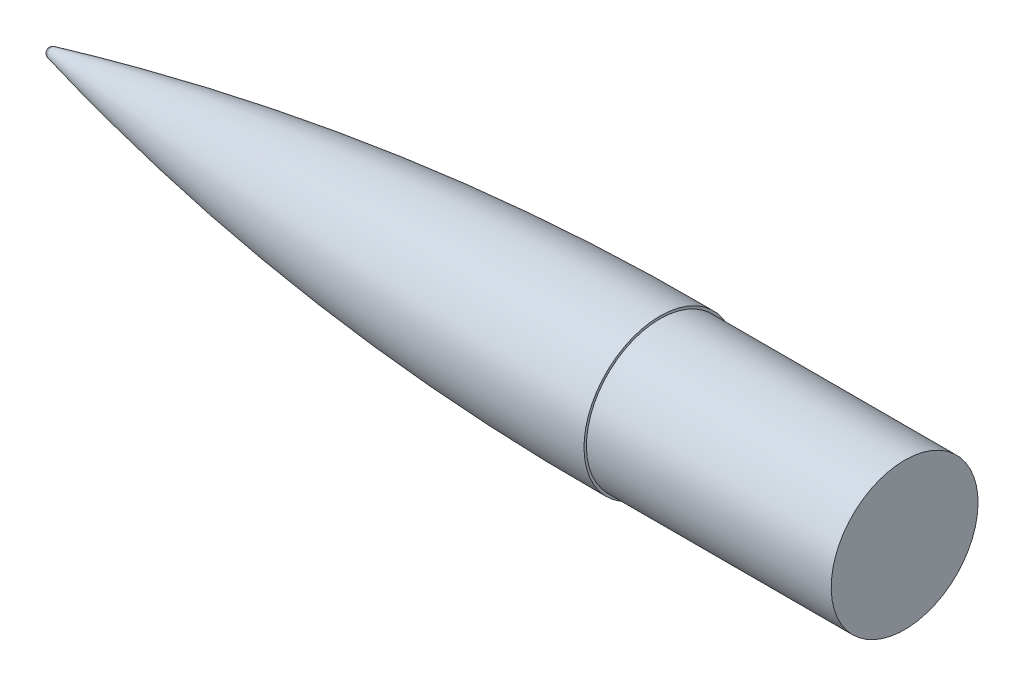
from build123d import *


with BuildPart() as part:
    # Sketch1 → Revolve2 (revolve)
    with BuildSketch(Plane.XY):
        with BuildLine():
            Line((452.525034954, 0), (8.025034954, 0))
            ThreePointArc((8.025034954, 0), (8.567797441, 1.569280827), (9.964123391, 2.467894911))
            ThreePointArc((9.964123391, 2.467894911), (166.61365154, 30.589847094), (325.525034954, 39.37))
            Line((325.525034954, 39.37), (325.525034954, 38.1))
            Line((325.525034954, 38.1), (452.525034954, 38.1))
            Line((452.525034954, 38.1), (452.525034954, 0))
        make_face()
    revolve(axis=Axis((452.525034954, 0, 0), (-1, 0, 0)))


solid = part.part
